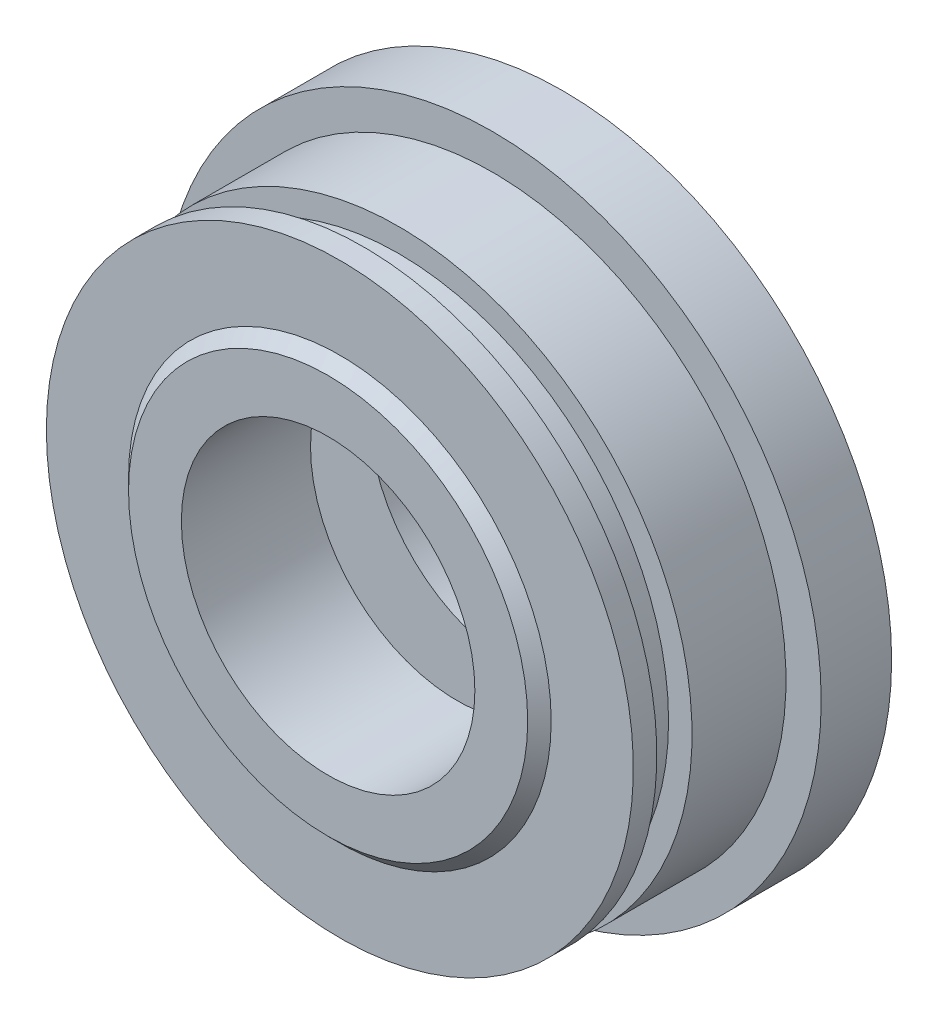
from build123d import *

# Parameters (mm, degrees)
ESQUISSE1_R      = 14
CYLINDRE_DEPTH   = 3
ESQUISSE2_R      = 12.5
EPAULEMENT_DEPTH = 6.5
ESQUISSE3_R      = 9
BOSSAGE_DEPTH    = 0.5
BOSSAGE_TAPER    = 45
ESQUISSE4_R      = 6.25
PER_AGE_DEPTH    = 23.181073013
ESQUISSE10_W     = 2.5
ESQUISSE10_H     = 5
ESQUISSE11_W     = 1.5
ESQUISSE11_H     = 2.5


with BuildPart() as part:
    # Esquisse1 → cylindre (new body)
    with BuildSketch(Plane.XY):
        Circle(ESQUISSE1_R)
    extrude(amount=CYLINDRE_DEPTH)

    # Esquisse2 → epaulement (add)
    with BuildSketch(Plane.XY.offset(3)):
        with Locations(Location((0, 0, 0), (0, 0, 180))):
            Circle(ESQUISSE2_R)
    extrude(amount=EPAULEMENT_DEPTH)

    # Esquisse3 → bossage (add)
    with BuildSketch(Plane.XY.offset(9.5)):
        Circle(ESQUISSE3_R)
    extrude(amount=BOSSAGE_DEPTH, taper=BOSSAGE_TAPER)

    # Esquisse4 → per_age (cut, through all)
    with BuildSketch(Plane.XY.offset(10)):
        Circle(ESQUISSE4_R)
    extrude(amount=-PER_AGE_DEPTH, mode=Mode.SUBTRACT)

    # Esquisse10 → gorge 16 (revolve, cut)
    with BuildSketch(Plane(origin=(0, 0, 0), x_dir=(0, 0, -1), z_dir=(1, 0, 0)), mode=Mode.PRIVATE) as gorge_16_sk:
        with Locations((-3.25, -7.75)):
            Rectangle(ESQUISSE10_W, ESQUISSE10_H)
    revolve(gorge_16_sk.sketch.rotate(Axis((0, 0, 0), (0, 0, 1)), 270), axis=Axis((0, 0, 0), (0, 0, 1)), mode=Mode.SUBTRACT)

    # Esquisse11 → gorge 17 (revolve, cut)
    with BuildSketch(Plane(origin=(0, 0, 0), x_dir=(0, 0, -1), z_dir=(1, 0, 0)), mode=Mode.PRIVATE) as gorge_17_sk:
        with Locations((-7.75, -12.75)):
            Rectangle(ESQUISSE11_W, ESQUISSE11_H)
    revolve(gorge_17_sk.sketch.rotate(Axis((0, 0, 0), (0, 0, 1)), 270), axis=Axis((0, 0, 0), (0, 0, 1)), mode=Mode.SUBTRACT)


solid = part.part
